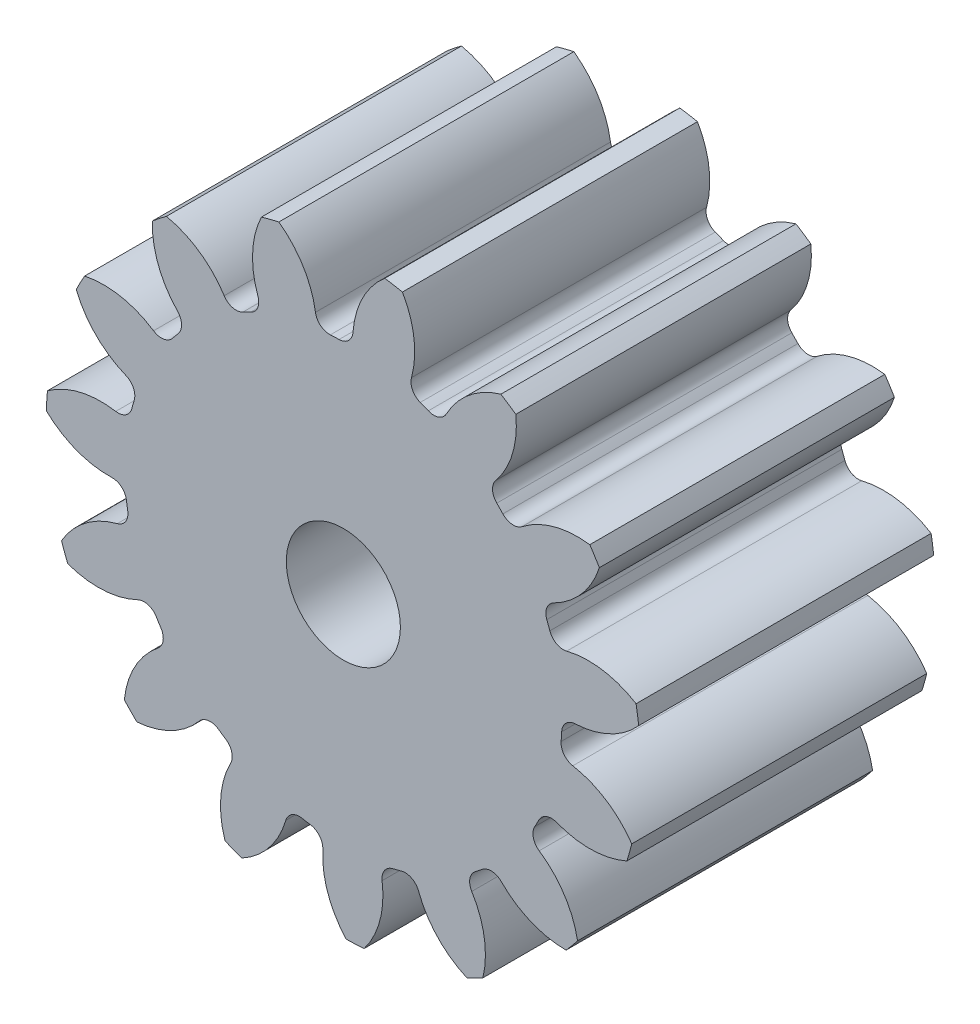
from build123d import *

# Parameters (mm, degrees)
SKETCH3_R         = 95.955555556
GEARBODY_DEPTH    = 95.25
TOOTHCUT_DEPTH    = 166.793545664
CIRPATTERN1_COUNT = 15
BOREDIA_R         = 18.415
BORE_DEPTH        = 12700


with BuildPart() as part:
    # Sketch3 → gearBody (new body)
    with BuildSketch(Plane.XY):
        Circle(SKETCH3_R)
    extrude(amount=GEARBODY_DEPTH)

    # Sketch2 → toothCut (cut, through all)
    with BuildSketch(Plane.XY):
        with BuildLine():
            ThreePointArc((70.299884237, -6.001057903), (70.405694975, -4.596143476), (70.483431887, -3.189396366))
            ThreePointArc((70.483431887, -3.189396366), (71.822663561, -0.15002605), (74.860553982, 1.192559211))
            ThreePointArc((74.860553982, 1.192559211), (86.504352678, 4.204647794), (95.955555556, 11.642758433))
            ThreePointArc((95.955555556, 11.642758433), (96.454006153, -6.29659932), (93.627532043, -24.018903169))
            ThreePointArc((93.627532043, -24.018903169), (85.223552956, -15.415191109), (74.070169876, -10.914883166))
            ThreePointArc((74.070169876, -10.914883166), (71.232608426, -9.188743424), (70.299884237, -6.001057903))
        make_face()
    toothcut = extrude(amount=TOOTHCUT_DEPTH, mode=Mode.SUBTRACT)

    # CirPattern1: toothCut ×15 about axis
    cirpattern1_axis = Axis((0, 0, 0), (0, 0, 1))
    for i in range(1, CIRPATTERN1_COUNT):
        add(toothcut.rotate(cirpattern1_axis, i * 360 / CIRPATTERN1_COUNT), mode=Mode.SUBTRACT)

    # boreDia → bore (cut, symmetric)
    with BuildSketch(Plane.XY):
        Circle(BOREDIA_R)
    extrude(amount=BORE_DEPTH, both=True, mode=Mode.SUBTRACT)


solid = part.part
